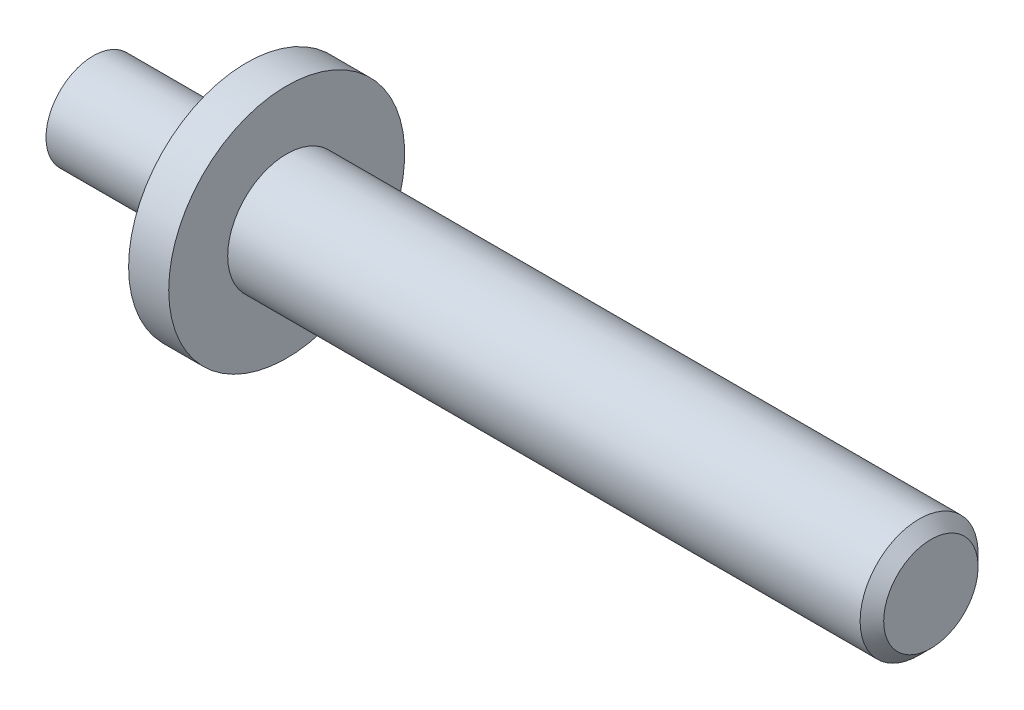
ISO-10303-21;
HEADER;
FILE_DESCRIPTION(('STEP AP214'),'2;1');
FILE_NAME('part.step','',(''),(''),'','','');
FILE_SCHEMA(('AUTOMOTIVE_DESIGN { 1 0 10303 214 1 1 1 1 }'));
ENDSEC;
DATA;
#1=APPLICATION_CONTEXT('core data for automotive mechanical design processes');
#2=APPLICATION_PROTOCOL_DEFINITION('international standard','automotive_design',2000,#1);
#3=PRODUCT_CONTEXT('',#1,'mechanical');
#4=PRODUCT('Part','Part','',(#3));
#5=PRODUCT_RELATED_PRODUCT_CATEGORY('part','',(#4));
#6=PRODUCT_DEFINITION_FORMATION('','',#4);
#7=PRODUCT_DEFINITION_CONTEXT('part definition',#1,'design');
#8=PRODUCT_DEFINITION('design','',#6,#7);
#9=PRODUCT_DEFINITION_SHAPE('','',#8);
#10=(LENGTH_UNIT() NAMED_UNIT(*) SI_UNIT(.MILLI.,.METRE.));
#11=(NAMED_UNIT(*) PLANE_ANGLE_UNIT() SI_UNIT($,.RADIAN.));
#12=(NAMED_UNIT(*) SI_UNIT($,.STERADIAN.) SOLID_ANGLE_UNIT());
#13=UNCERTAINTY_MEASURE_WITH_UNIT(LENGTH_MEASURE(1.E-05),#10,'distance_accuracy_value','');
#14=(GEOMETRIC_REPRESENTATION_CONTEXT(3) GLOBAL_UNCERTAINTY_ASSIGNED_CONTEXT((#13)) GLOBAL_UNIT_ASSIGNED_CONTEXT((#10,
#11,#12)) REPRESENTATION_CONTEXT('',''));
#15=CARTESIAN_POINT('',(0.,0.,0.));
#16=DIRECTION('',(0.,0.,1.));
#17=DIRECTION('',(1.,0.,0.));
#18=AXIS2_PLACEMENT_3D('',#15,#16,#17);
#19=CARTESIAN_POINT('',(0.,4.,0.));
#20=DIRECTION('',(1.,0.,0.));
#21=DIRECTION('',(0.,0.,-1.));
#22=AXIS2_PLACEMENT_3D('',#19,#20,#21);
#23=PLANE('',#22);
#24=CARTESIAN_POINT('',(0.,0.,0.));
#25=DIRECTION('',(-1.,0.,0.));
#26=DIRECTION('',(0.,0.,1.));
#27=AXIS2_PLACEMENT_3D('',#24,#25,#26);
#28=CIRCLE('',#27,4.);
#29=CARTESIAN_POINT('',(0.,0.,4.));
#30=VERTEX_POINT('',#29);
#31=EDGE_CURVE('E64',#30,#30,#28,.T.);
#32=ORIENTED_EDGE('',*,*,#31,.T.);
#33=EDGE_LOOP('',(#32));
#34=FACE_BOUND('',#33,.T.);
#35=ADVANCED_FACE('F35',(#34),#23,.F.);
#36=CARTESIAN_POINT('',(71.,0.,0.));
#37=DIRECTION('',(-1.,0.,0.));
#38=DIRECTION('',(0.,0.,1.));
#39=AXIS2_PLACEMENT_3D('',#36,#37,#38);
#40=PLANE('',#39);
#41=CARTESIAN_POINT('',(71.,0.,0.));
#42=DIRECTION('',(-1.,0.,0.));
#43=DIRECTION('',(0.,0.,1.));
#44=AXIS2_PLACEMENT_3D('',#41,#42,#43);
#45=CIRCLE('',#44,3.99999999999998);
#46=CARTESIAN_POINT('',(71.,0.,3.99999999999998));
#47=VERTEX_POINT('',#46);
#48=EDGE_CURVE('E10',#47,#47,#45,.F.);
#49=ORIENTED_EDGE('',*,*,#48,.T.);
#50=EDGE_LOOP('',(#49));
#51=FACE_BOUND('',#50,.T.);
#52=ADVANCED_FACE('F84',(#51),#40,.F.);
#53=CARTESIAN_POINT('',(0.,0.,0.));
#54=DIRECTION('',(-1.,0.,0.));
#55=DIRECTION('',(0.,0.,1.));
#56=AXIS2_PLACEMENT_3D('',#53,#54,#55);
#57=CYLINDRICAL_SURFACE('',#56,5.);
#58=CARTESIAN_POINT('',(70.,0.,0.));
#59=DIRECTION('',(-1.,0.,0.));
#60=DIRECTION('',(0.,0.,1.));
#61=AXIS2_PLACEMENT_3D('',#58,#59,#60);
#62=CIRCLE('',#61,5.);
#63=CARTESIAN_POINT('',(70.,0.,5.));
#64=VERTEX_POINT('',#63);
#65=EDGE_CURVE('E42',#64,#64,#62,.T.);
#66=ORIENTED_EDGE('',*,*,#65,.T.);
#67=EDGE_LOOP('',(#66));
#68=FACE_BOUND('',#67,.T.);
#69=CARTESIAN_POINT('',(16.4,0.,0.));
#70=DIRECTION('',(-1.,0.,0.));
#71=DIRECTION('',(0.,0.,1.));
#72=AXIS2_PLACEMENT_3D('',#69,#70,#71);
#73=CIRCLE('',#72,4.99999999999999);
#74=CARTESIAN_POINT('',(16.4,0.,4.99999999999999));
#75=VERTEX_POINT('',#74);
#76=EDGE_CURVE('E55',#75,#75,#73,.T.);
#77=ORIENTED_EDGE('',*,*,#76,.F.);
#78=EDGE_LOOP('',(#77));
#79=FACE_BOUND('',#78,.T.);
#80=ADVANCED_FACE('F89',(#68,#79),#57,.T.);
#81=CARTESIAN_POINT('',(16.4,4.99999999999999,0.));
#82=DIRECTION('',(-1.,0.,0.));
#83=DIRECTION('',(0.,0.,1.));
#84=AXIS2_PLACEMENT_3D('',#81,#82,#83);
#85=PLANE('',#84);
#86=CARTESIAN_POINT('',(16.4,0.,0.));
#87=DIRECTION('',(-1.,0.,0.));
#88=DIRECTION('',(0.,0.,1.));
#89=AXIS2_PLACEMENT_3D('',#86,#87,#88);
#90=CIRCLE('',#89,10.);
#91=CARTESIAN_POINT('',(16.4,0.,10.));
#92=VERTEX_POINT('',#91);
#93=EDGE_CURVE('E58',#92,#92,#90,.T.);
#94=ORIENTED_EDGE('',*,*,#93,.F.);
#95=EDGE_LOOP('',(#94));
#96=FACE_BOUND('',#95,.T.);
#97=ORIENTED_EDGE('',*,*,#76,.T.);
#98=EDGE_LOOP('',(#97));
#99=FACE_BOUND('',#98,.T.);
#100=ADVANCED_FACE('F94',(#96,#99),#85,.F.);
#101=CARTESIAN_POINT('',(0.,0.,0.));
#102=DIRECTION('',(-1.,0.,0.));
#103=DIRECTION('',(0.,0.,1.));
#104=AXIS2_PLACEMENT_3D('',#101,#102,#103);
#105=CYLINDRICAL_SURFACE('',#104,10.);
#106=CARTESIAN_POINT('',(13.,0.,0.));
#107=DIRECTION('',(-1.,0.,0.));
#108=DIRECTION('',(0.,0.,1.));
#109=AXIS2_PLACEMENT_3D('',#106,#107,#108);
#110=CIRCLE('',#109,10.);
#111=CARTESIAN_POINT('',(13.,0.,10.));
#112=VERTEX_POINT('',#111);
#113=EDGE_CURVE('E61',#112,#112,#110,.T.);
#114=ORIENTED_EDGE('',*,*,#113,.F.);
#115=EDGE_LOOP('',(#114));
#116=FACE_BOUND('',#115,.T.);
#117=ORIENTED_EDGE('',*,*,#93,.T.);
#118=EDGE_LOOP('',(#117));
#119=FACE_BOUND('',#118,.T.);
#120=ADVANCED_FACE('F80',(#116,#119),#105,.T.);
#121=CARTESIAN_POINT('',(13.,10.,0.));
#122=DIRECTION('',(1.,0.,0.));
#123=DIRECTION('',(0.,0.,-1.));
#124=AXIS2_PLACEMENT_3D('',#121,#122,#123);
#125=PLANE('',#124);
#126=CARTESIAN_POINT('',(13.,0.,0.));
#127=DIRECTION('',(1.,0.,0.));
#128=DIRECTION('',(0.,0.,-1.));
#129=AXIS2_PLACEMENT_3D('',#126,#127,#128);
#130=CIRCLE('',#129,6.);
#131=CARTESIAN_POINT('',(13.,0.,-6.));
#132=VERTEX_POINT('',#131);
#133=EDGE_CURVE('E46',#132,#132,#130,.T.);
#134=ORIENTED_EDGE('',*,*,#133,.T.);
#135=EDGE_LOOP('',(#134));
#136=FACE_BOUND('',#135,.T.);
#137=ORIENTED_EDGE('',*,*,#113,.T.);
#138=EDGE_LOOP('',(#137));
#139=FACE_BOUND('',#138,.T.);
#140=ADVANCED_FACE('F72',(#136,#139),#125,.F.);
#141=CARTESIAN_POINT('',(0.,0.,0.));
#142=DIRECTION('',(-1.,0.,0.));
#143=DIRECTION('',(0.,0.,1.));
#144=AXIS2_PLACEMENT_3D('',#141,#142,#143);
#145=CYLINDRICAL_SURFACE('',#144,4.);
#146=CARTESIAN_POINT('',(11.,0.,0.));
#147=DIRECTION('',(1.,0.,0.));
#148=DIRECTION('',(0.,0.,-1.));
#149=AXIS2_PLACEMENT_3D('',#146,#147,#148);
#150=CIRCLE('',#149,4.);
#151=CARTESIAN_POINT('',(11.,0.,-4.));
#152=VERTEX_POINT('',#151);
#153=EDGE_CURVE('E50',#152,#152,#150,.F.);
#154=ORIENTED_EDGE('',*,*,#153,.T.);
#155=EDGE_LOOP('',(#154));
#156=FACE_BOUND('',#155,.T.);
#157=ORIENTED_EDGE('',*,*,#31,.F.);
#158=EDGE_LOOP('',(#157));
#159=FACE_BOUND('',#158,.T.);
#160=ADVANCED_FACE('F69',(#156,#159),#145,.T.);
#161=CARTESIAN_POINT('',(11.,0.,0.));
#162=DIRECTION('',(1.,0.,0.));
#163=DIRECTION('',(0.,0.,-1.));
#164=AXIS2_PLACEMENT_3D('',#161,#162,#163);
#165=TOROIDAL_SURFACE('',#164,6.,2.);
#166=ORIENTED_EDGE('',*,*,#133,.F.);
#167=EDGE_LOOP('',(#166));
#168=FACE_BOUND('',#167,.T.);
#169=ORIENTED_EDGE('',*,*,#153,.F.);
#170=EDGE_LOOP('',(#169));
#171=FACE_BOUND('',#170,.T.);
#172=ADVANCED_FACE('F71',(#168,#171),#165,.F.);
#173=CARTESIAN_POINT('',(70.,0.,0.));
#174=DIRECTION('',(-1.,0.,0.));
#175=DIRECTION('',(0.,0.,1.));
#176=AXIS2_PLACEMENT_3D('',#173,#174,#175);
#177=CONICAL_SURFACE('',#176,5.,0.785398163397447);
#178=ORIENTED_EDGE('',*,*,#48,.F.);
#179=EDGE_LOOP('',(#178));
#180=FACE_BOUND('',#179,.T.);
#181=ORIENTED_EDGE('',*,*,#65,.F.);
#182=EDGE_LOOP('',(#181));
#183=FACE_BOUND('',#182,.T.);
#184=ADVANCED_FACE('F37',(#180,#183),#177,.T.);
#185=CLOSED_SHELL('',(#35,#52,#80,#100,#120,#140,#160,#172,#184));
#186=MANIFOLD_SOLID_BREP('B2',#185);
#187=ADVANCED_BREP_SHAPE_REPRESENTATION('',(#18,#186),#14);
#188=SHAPE_DEFINITION_REPRESENTATION(#9,#187);
ENDSEC;
END-ISO-10303-21;
